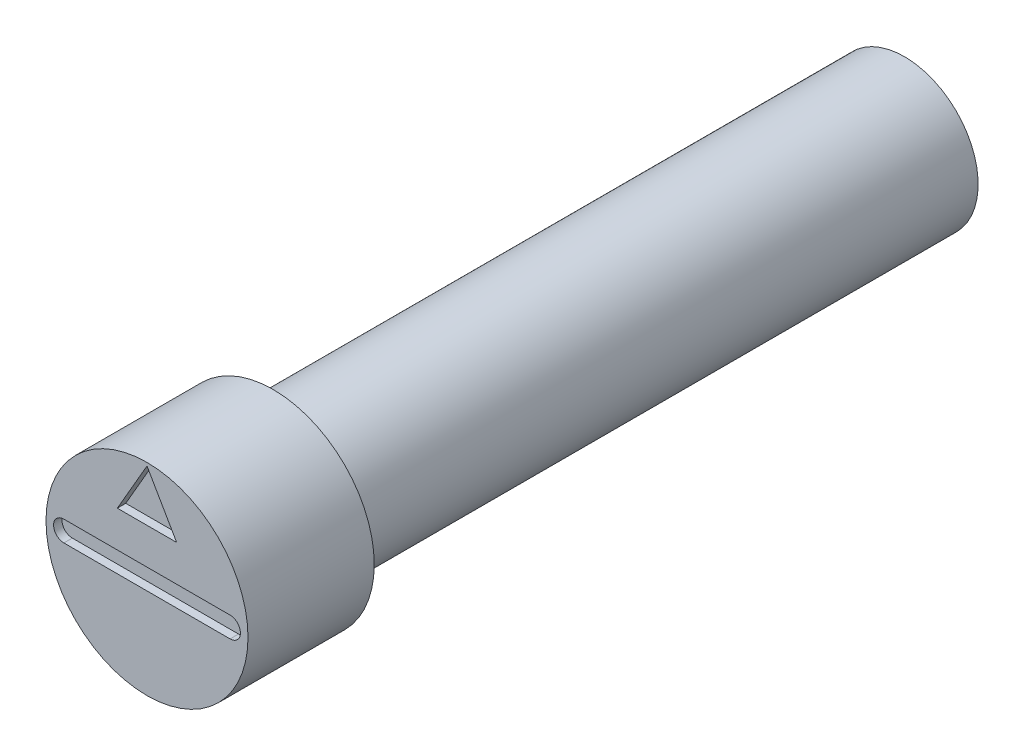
ISO-10303-21;
HEADER;
FILE_DESCRIPTION(('STEP AP214'),'2;1');
FILE_NAME('part.step','',(''),(''),'','','');
FILE_SCHEMA(('AUTOMOTIVE_DESIGN { 1 0 10303 214 1 1 1 1 }'));
ENDSEC;
DATA;
#1=APPLICATION_CONTEXT('core data for automotive mechanical design processes');
#2=APPLICATION_PROTOCOL_DEFINITION('international standard','automotive_design',2000,#1);
#3=PRODUCT_CONTEXT('',#1,'mechanical');
#4=PRODUCT('Part','Part','',(#3));
#5=PRODUCT_RELATED_PRODUCT_CATEGORY('part','',(#4));
#6=PRODUCT_DEFINITION_FORMATION('','',#4);
#7=PRODUCT_DEFINITION_CONTEXT('part definition',#1,'design');
#8=PRODUCT_DEFINITION('design','',#6,#7);
#9=PRODUCT_DEFINITION_SHAPE('','',#8);
#10=(LENGTH_UNIT() NAMED_UNIT(*) SI_UNIT(.MILLI.,.METRE.));
#11=(NAMED_UNIT(*) PLANE_ANGLE_UNIT() SI_UNIT($,.RADIAN.));
#12=(NAMED_UNIT(*) SI_UNIT($,.STERADIAN.) SOLID_ANGLE_UNIT());
#13=UNCERTAINTY_MEASURE_WITH_UNIT(LENGTH_MEASURE(1.E-05),#10,'distance_accuracy_value','');
#14=(GEOMETRIC_REPRESENTATION_CONTEXT(3) GLOBAL_UNCERTAINTY_ASSIGNED_CONTEXT((#13)) GLOBAL_UNIT_ASSIGNED_CONTEXT((#10,
#11,#12)) REPRESENTATION_CONTEXT('',''));
#15=CARTESIAN_POINT('',(0.,0.,0.));
#16=DIRECTION('',(0.,0.,1.));
#17=DIRECTION('',(1.,0.,0.));
#18=AXIS2_PLACEMENT_3D('',#15,#16,#17);
#19=CARTESIAN_POINT('',(1.1999976,0.,0.));
#20=DIRECTION('',(0.,0.,1.));
#21=DIRECTION('',(1.,0.,0.));
#22=AXIS2_PLACEMENT_3D('',#19,#20,#21);
#23=PLANE('',#22);
#24=CARTESIAN_POINT('',(-1.975,0.,0.));
#25=DIRECTION('',(0.,0.,1.));
#26=DIRECTION('',(1.,0.,0.));
#27=AXIS2_PLACEMENT_3D('',#24,#25,#26);
#28=CIRCLE('',#27,0.245);
#29=CARTESIAN_POINT('',(-1.975,0.245,0.));
#30=VERTEX_POINT('',#29);
#31=CARTESIAN_POINT('',(-1.975,-0.245,0.));
#32=VERTEX_POINT('',#31);
#33=EDGE_CURVE('E52',#30,#32,#28,.T.);
#34=ORIENTED_EDGE('',*,*,#33,.F.);
#35=DIRECTION('',(-1.,0.,0.));
#36=VECTOR('',#35,1.);
#37=CARTESIAN_POINT('',(-1.975,0.245,0.));
#38=LINE('',#37,#36);
#39=CARTESIAN_POINT('',(1.975,0.245,0.));
#40=VERTEX_POINT('',#39);
#41=EDGE_CURVE('E116',#40,#30,#38,.T.);
#42=ORIENTED_EDGE('',*,*,#41,.F.);
#43=CARTESIAN_POINT('',(1.975,0.,0.));
#44=DIRECTION('',(0.,0.,1.));
#45=DIRECTION('',(1.,0.,0.));
#46=AXIS2_PLACEMENT_3D('',#43,#44,#45);
#47=CIRCLE('',#46,0.245);
#48=CARTESIAN_POINT('',(1.975,-0.245,0.));
#49=VERTEX_POINT('',#48);
#50=EDGE_CURVE('E119',#49,#40,#47,.T.);
#51=ORIENTED_EDGE('',*,*,#50,.F.);
#52=DIRECTION('',(1.,0.,0.));
#53=VECTOR('',#52,1.);
#54=CARTESIAN_POINT('',(-1.975,-0.245,0.));
#55=LINE('',#54,#53);
#56=EDGE_CURVE('E125',#32,#49,#55,.T.);
#57=ORIENTED_EDGE('',*,*,#56,.F.);
#58=EDGE_LOOP('',(#34,#42,#51,#57));
#59=FACE_BOUND('',#58,.T.);
#60=DIRECTION('',(-0.499999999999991,0.866025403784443,0.));
#61=VECTOR('',#60,1.);
#62=CARTESIAN_POINT('',(0.704999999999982,1.105,0.));
#63=LINE('',#62,#61);
#64=CARTESIAN_POINT('',(0.704999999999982,1.105,0.));
#65=VERTEX_POINT('',#64);
#66=CARTESIAN_POINT('',(0.,2.32609581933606,0.));
#67=VERTEX_POINT('',#66);
#68=EDGE_CURVE('E60',#65,#67,#63,.T.);
#69=ORIENTED_EDGE('',*,*,#68,.F.);
#70=DIRECTION('',(1.,0.,0.));
#71=VECTOR('',#70,1.);
#72=CARTESIAN_POINT('',(-0.705000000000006,1.105,0.));
#73=LINE('',#72,#71);
#74=CARTESIAN_POINT('',(-0.705000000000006,1.105,0.));
#75=VERTEX_POINT('',#74);
#76=EDGE_CURVE('E138',#75,#65,#73,.T.);
#77=ORIENTED_EDGE('',*,*,#76,.F.);
#78=DIRECTION('',(-0.500000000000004,-0.866025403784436,0.));
#79=VECTOR('',#78,1.);
#80=CARTESIAN_POINT('',(0.,2.32609581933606,0.));
#81=LINE('',#80,#79);
#82=EDGE_CURVE('E146',#67,#75,#81,.T.);
#83=ORIENTED_EDGE('',*,*,#82,.F.);
#84=EDGE_LOOP('',(#69,#77,#83));
#85=FACE_BOUND('',#84,.T.);
#86=CARTESIAN_POINT('',(0.,0.,0.));
#87=DIRECTION('',(0.,0.,-1.));
#88=DIRECTION('',(-1.,0.,0.));
#89=AXIS2_PLACEMENT_3D('',#86,#87,#88);
#90=CIRCLE('',#89,2.3999952);
#91=CARTESIAN_POINT('',(-2.3999952,0.,0.));
#92=VERTEX_POINT('',#91);
#93=EDGE_CURVE('E39',#92,#92,#90,.T.);
#94=ORIENTED_EDGE('',*,*,#93,.F.);
#95=EDGE_LOOP('',(#94));
#96=FACE_BOUND('',#95,.T.);
#97=ADVANCED_FACE('F36',(#59,#85,#96),#23,.T.);
#98=CARTESIAN_POINT('',(0.,0.,-1.499997));
#99=DIRECTION('',(0.,0.,-1.));
#100=DIRECTION('',(-1.,0.,0.));
#101=AXIS2_PLACEMENT_3D('',#98,#99,#100);
#102=CYLINDRICAL_SURFACE('',#101,2.3999952);
#103=ORIENTED_EDGE('',*,*,#93,.T.);
#104=EDGE_LOOP('',(#103));
#105=FACE_BOUND('',#104,.T.);
#106=CARTESIAN_POINT('',(0.,0.,-2.999994));
#107=DIRECTION('',(0.,0.,-1.));
#108=DIRECTION('',(-1.,0.,0.));
#109=AXIS2_PLACEMENT_3D('',#106,#107,#108);
#110=CIRCLE('',#109,2.3999952);
#111=CARTESIAN_POINT('',(-2.3999952,0.,-2.999994));
#112=VERTEX_POINT('',#111);
#113=EDGE_CURVE('E157',#112,#112,#110,.T.);
#114=ORIENTED_EDGE('',*,*,#113,.F.);
#115=EDGE_LOOP('',(#114));
#116=FACE_BOUND('',#115,.T.);
#117=ADVANCED_FACE('F164',(#105,#116),#102,.T.);
#118=CARTESIAN_POINT('',(0.87499825,0.,-17.999964));
#119=DIRECTION('',(0.,0.,-1.));
#120=DIRECTION('',(-1.,0.,0.));
#121=AXIS2_PLACEMENT_3D('',#118,#119,#120);
#122=PLANE('',#121);
#123=CARTESIAN_POINT('',(0.,0.,-17.999964));
#124=DIRECTION('',(0.,0.,-1.));
#125=DIRECTION('',(-1.,0.,0.));
#126=AXIS2_PLACEMENT_3D('',#123,#124,#125);
#127=CIRCLE('',#126,1.7499965);
#128=CARTESIAN_POINT('',(-1.74999649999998,0.,-17.999964));
#129=VERTEX_POINT('',#128);
#130=EDGE_CURVE('E44',#129,#129,#127,.F.);
#131=ORIENTED_EDGE('',*,*,#130,.F.);
#132=EDGE_LOOP('',(#131));
#133=FACE_BOUND('',#132,.T.);
#134=ADVANCED_FACE('F173',(#133),#122,.T.);
#135=CARTESIAN_POINT('',(2.07499585,0.,-2.999994));
#136=DIRECTION('',(0.,0.,-1.));
#137=DIRECTION('',(-1.,0.,0.));
#138=AXIS2_PLACEMENT_3D('',#135,#136,#137);
#139=PLANE('',#138);
#140=CARTESIAN_POINT('',(0.,0.,-2.999994));
#141=DIRECTION('',(0.,0.,-1.));
#142=DIRECTION('',(-1.,0.,0.));
#143=AXIS2_PLACEMENT_3D('',#140,#141,#142);
#144=CIRCLE('',#143,1.7499965);
#145=CARTESIAN_POINT('',(-1.74999649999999,0.,-2.999994));
#146=VERTEX_POINT('',#145);
#147=EDGE_CURVE('E11',#146,#146,#144,.T.);
#148=ORIENTED_EDGE('',*,*,#147,.F.);
#149=EDGE_LOOP('',(#148));
#150=FACE_BOUND('',#149,.T.);
#151=ORIENTED_EDGE('',*,*,#113,.T.);
#152=EDGE_LOOP('',(#151));
#153=FACE_BOUND('',#152,.T.);
#154=ADVANCED_FACE('F180',(#150,#153),#139,.T.);
#155=CARTESIAN_POINT('',(0.,0.,-10.499979));
#156=DIRECTION('',(0.,0.,-1.));
#157=DIRECTION('',(-1.,0.,0.));
#158=AXIS2_PLACEMENT_3D('',#155,#156,#157);
#159=CYLINDRICAL_SURFACE('',#158,1.7499965);
#160=ORIENTED_EDGE('',*,*,#130,.T.);
#161=EDGE_LOOP('',(#160));
#162=FACE_BOUND('',#161,.T.);
#163=ORIENTED_EDGE('',*,*,#147,.T.);
#164=EDGE_LOOP('',(#163));
#165=FACE_BOUND('',#164,.T.);
#166=ADVANCED_FACE('F177',(#162,#165),#159,.T.);
#167=CARTESIAN_POINT('',(0.704999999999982,1.105,-0.2));
#168=DIRECTION('',(0.866025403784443,0.499999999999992,0.));
#169=DIRECTION('',(-0.499999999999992,0.866025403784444,0.));
#170=AXIS2_PLACEMENT_3D('',#167,#168,#169);
#171=PLANE('',#170);
#172=ORIENTED_EDGE('',*,*,#68,.T.);
#173=DIRECTION('',(0.,0.,1.));
#174=VECTOR('',#173,1.);
#175=CARTESIAN_POINT('',(0.,2.32609581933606,-0.2));
#176=LINE('',#175,#174);
#177=CARTESIAN_POINT('',(0.,2.32609581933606,-0.2));
#178=VERTEX_POINT('',#177);
#179=EDGE_CURVE('E144',#178,#67,#176,.T.);
#180=ORIENTED_EDGE('',*,*,#179,.F.);
#181=DIRECTION('',(-0.499999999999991,0.866025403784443,0.));
#182=VECTOR('',#181,1.);
#183=CARTESIAN_POINT('',(0.704999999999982,1.105,-0.2));
#184=LINE('',#183,#182);
#185=CARTESIAN_POINT('',(0.704999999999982,1.105,-0.2));
#186=VERTEX_POINT('',#185);
#187=EDGE_CURVE('E134',#186,#178,#184,.T.);
#188=ORIENTED_EDGE('',*,*,#187,.F.);
#189=DIRECTION('',(0.,0.,1.));
#190=VECTOR('',#189,1.);
#191=CARTESIAN_POINT('',(0.704999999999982,1.105,-0.2));
#192=LINE('',#191,#190);
#193=EDGE_CURVE('E151',#186,#65,#192,.T.);
#194=ORIENTED_EDGE('',*,*,#193,.T.);
#195=EDGE_LOOP('',(#172,#180,#188,#194));
#196=FACE_BOUND('',#195,.T.);
#197=ADVANCED_FACE('F169',(#196),#171,.F.);
#198=CARTESIAN_POINT('',(-0.705000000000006,1.105,-0.2));
#199=DIRECTION('',(0.,-1.,0.));
#200=DIRECTION('',(1.,0.,0.));
#201=AXIS2_PLACEMENT_3D('',#198,#199,#200);
#202=PLANE('',#201);
#203=ORIENTED_EDGE('',*,*,#76,.T.);
#204=ORIENTED_EDGE('',*,*,#193,.F.);
#205=DIRECTION('',(1.,0.,0.));
#206=VECTOR('',#205,1.);
#207=CARTESIAN_POINT('',(-0.705000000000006,1.105,-0.2));
#208=LINE('',#207,#206);
#209=CARTESIAN_POINT('',(-0.705000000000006,1.105,-0.2));
#210=VERTEX_POINT('',#209);
#211=EDGE_CURVE('E141',#210,#186,#208,.T.);
#212=ORIENTED_EDGE('',*,*,#211,.F.);
#213=DIRECTION('',(0.,0.,1.));
#214=VECTOR('',#213,1.);
#215=CARTESIAN_POINT('',(-0.705000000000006,1.105,-0.2));
#216=LINE('',#215,#214);
#217=EDGE_CURVE('E153',#210,#75,#216,.T.);
#218=ORIENTED_EDGE('',*,*,#217,.T.);
#219=EDGE_LOOP('',(#203,#204,#212,#218));
#220=FACE_BOUND('',#219,.T.);
#221=ADVANCED_FACE('F176',(#220),#202,.F.);
#222=CARTESIAN_POINT('',(0.,2.32609581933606,-0.2));
#223=DIRECTION('',(-0.866025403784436,0.500000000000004,0.));
#224=DIRECTION('',(-0.500000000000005,-0.866025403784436,0.));
#225=AXIS2_PLACEMENT_3D('',#222,#223,#224);
#226=PLANE('',#225);
#227=ORIENTED_EDGE('',*,*,#82,.T.);
#228=ORIENTED_EDGE('',*,*,#217,.F.);
#229=DIRECTION('',(-0.500000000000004,-0.866025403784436,0.));
#230=VECTOR('',#229,1.);
#231=CARTESIAN_POINT('',(0.,2.32609581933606,-0.2));
#232=LINE('',#231,#230);
#233=EDGE_CURVE('E137',#178,#210,#232,.T.);
#234=ORIENTED_EDGE('',*,*,#233,.F.);
#235=ORIENTED_EDGE('',*,*,#179,.T.);
#236=EDGE_LOOP('',(#227,#228,#234,#235));
#237=FACE_BOUND('',#236,.T.);
#238=ADVANCED_FACE('F232',(#237),#226,.F.);
#239=CARTESIAN_POINT('',(0.,0.,-0.2));
#240=DIRECTION('',(0.,0.,1.));
#241=DIRECTION('',(1.,0.,0.));
#242=AXIS2_PLACEMENT_3D('',#239,#240,#241);
#243=PLANE('',#242);
#244=ORIENTED_EDGE('',*,*,#187,.T.);
#245=ORIENTED_EDGE('',*,*,#233,.T.);
#246=ORIENTED_EDGE('',*,*,#211,.T.);
#247=EDGE_LOOP('',(#244,#245,#246));
#248=FACE_BOUND('',#247,.T.);
#249=ADVANCED_FACE('F243',(#248),#243,.T.);
#250=CARTESIAN_POINT('',(-1.975,0.,-0.2));
#251=DIRECTION('',(0.,0.,1.));
#252=DIRECTION('',(1.,0.,0.));
#253=AXIS2_PLACEMENT_3D('',#250,#251,#252);
#254=CYLINDRICAL_SURFACE('',#253,0.245);
#255=ORIENTED_EDGE('',*,*,#33,.T.);
#256=DIRECTION('',(0.,0.,1.));
#257=VECTOR('',#256,1.);
#258=CARTESIAN_POINT('',(-1.975,-0.245,-0.2));
#259=LINE('',#258,#257);
#260=CARTESIAN_POINT('',(-1.975,-0.245,-0.2));
#261=VERTEX_POINT('',#260);
#262=EDGE_CURVE('E94',#261,#32,#259,.T.);
#263=ORIENTED_EDGE('',*,*,#262,.F.);
#264=CARTESIAN_POINT('',(-1.975,0.,-0.2));
#265=DIRECTION('',(0.,0.,1.));
#266=DIRECTION('',(1.,0.,0.));
#267=AXIS2_PLACEMENT_3D('',#264,#265,#266);
#268=CIRCLE('',#267,0.245);
#269=CARTESIAN_POINT('',(-1.975,0.245,-0.2));
#270=VERTEX_POINT('',#269);
#271=EDGE_CURVE('E98',#270,#261,#268,.T.);
#272=ORIENTED_EDGE('',*,*,#271,.F.);
#273=DIRECTION('',(0.,0.,1.));
#274=VECTOR('',#273,1.);
#275=CARTESIAN_POINT('',(-1.975,0.245,-0.2));
#276=LINE('',#275,#274);
#277=EDGE_CURVE('E129',#270,#30,#276,.T.);
#278=ORIENTED_EDGE('',*,*,#277,.T.);
#279=EDGE_LOOP('',(#255,#263,#272,#278));
#280=FACE_BOUND('',#279,.T.);
#281=ADVANCED_FACE('F96',(#280),#254,.F.);
#282=CARTESIAN_POINT('',(-1.975,0.245,-0.2));
#283=DIRECTION('',(0.,1.,0.));
#284=DIRECTION('',(0.,0.,1.));
#285=AXIS2_PLACEMENT_3D('',#282,#283,#284);
#286=PLANE('',#285);
#287=ORIENTED_EDGE('',*,*,#41,.T.);
#288=ORIENTED_EDGE('',*,*,#277,.F.);
#289=DIRECTION('',(-1.,0.,0.));
#290=VECTOR('',#289,1.);
#291=CARTESIAN_POINT('',(-1.975,0.245,-0.2));
#292=LINE('',#291,#290);
#293=CARTESIAN_POINT('',(1.975,0.245,-0.2));
#294=VERTEX_POINT('',#293);
#295=EDGE_CURVE('E104',#294,#270,#292,.T.);
#296=ORIENTED_EDGE('',*,*,#295,.F.);
#297=DIRECTION('',(0.,0.,1.));
#298=VECTOR('',#297,1.);
#299=CARTESIAN_POINT('',(1.975,0.245,-0.2));
#300=LINE('',#299,#298);
#301=EDGE_CURVE('E131',#294,#40,#300,.T.);
#302=ORIENTED_EDGE('',*,*,#301,.T.);
#303=EDGE_LOOP('',(#287,#288,#296,#302));
#304=FACE_BOUND('',#303,.T.);
#305=ADVANCED_FACE('F263',(#304),#286,.F.);
#306=CARTESIAN_POINT('',(1.975,0.,-0.2));
#307=DIRECTION('',(0.,0.,1.));
#308=DIRECTION('',(1.,0.,0.));
#309=AXIS2_PLACEMENT_3D('',#306,#307,#308);
#310=CYLINDRICAL_SURFACE('',#309,0.245);
#311=ORIENTED_EDGE('',*,*,#50,.T.);
#312=ORIENTED_EDGE('',*,*,#301,.F.);
#313=CARTESIAN_POINT('',(1.975,0.,-0.2));
#314=DIRECTION('',(0.,0.,1.));
#315=DIRECTION('',(1.,0.,0.));
#316=AXIS2_PLACEMENT_3D('',#313,#314,#315);
#317=CIRCLE('',#316,0.245);
#318=CARTESIAN_POINT('',(1.975,-0.245,-0.2));
#319=VERTEX_POINT('',#318);
#320=EDGE_CURVE('E112',#319,#294,#317,.T.);
#321=ORIENTED_EDGE('',*,*,#320,.F.);
#322=DIRECTION('',(0.,0.,1.));
#323=VECTOR('',#322,1.);
#324=CARTESIAN_POINT('',(1.975,-0.245,-0.2));
#325=LINE('',#324,#323);
#326=EDGE_CURVE('E103',#319,#49,#325,.T.);
#327=ORIENTED_EDGE('',*,*,#326,.T.);
#328=EDGE_LOOP('',(#311,#312,#321,#327));
#329=FACE_BOUND('',#328,.T.);
#330=ADVANCED_FACE('F273',(#329),#310,.F.);
#331=CARTESIAN_POINT('',(-1.975,-0.245,-0.2));
#332=DIRECTION('',(0.,-1.,0.));
#333=DIRECTION('',(0.,0.,-1.));
#334=AXIS2_PLACEMENT_3D('',#331,#332,#333);
#335=PLANE('',#334);
#336=ORIENTED_EDGE('',*,*,#56,.T.);
#337=ORIENTED_EDGE('',*,*,#326,.F.);
#338=DIRECTION('',(1.,0.,0.));
#339=VECTOR('',#338,1.);
#340=CARTESIAN_POINT('',(-1.975,-0.245,-0.2));
#341=LINE('',#340,#339);
#342=EDGE_CURVE('E107',#261,#319,#341,.T.);
#343=ORIENTED_EDGE('',*,*,#342,.F.);
#344=ORIENTED_EDGE('',*,*,#262,.T.);
#345=EDGE_LOOP('',(#336,#337,#343,#344));
#346=FACE_BOUND('',#345,.T.);
#347=ADVANCED_FACE('F108',(#346),#335,.F.);
#348=CARTESIAN_POINT('',(-1.975,0.,-0.2));
#349=DIRECTION('',(0.,0.,1.));
#350=DIRECTION('',(1.,0.,0.));
#351=AXIS2_PLACEMENT_3D('',#348,#349,#350);
#352=PLANE('',#351);
#353=ORIENTED_EDGE('',*,*,#271,.T.);
#354=ORIENTED_EDGE('',*,*,#342,.T.);
#355=ORIENTED_EDGE('',*,*,#320,.T.);
#356=ORIENTED_EDGE('',*,*,#295,.T.);
#357=EDGE_LOOP('',(#353,#354,#355,#356));
#358=FACE_BOUND('',#357,.T.);
#359=ADVANCED_FACE('F114',(#358),#352,.T.);
#360=CLOSED_SHELL('',(#97,#117,#134,#154,#166,#197,#221,#238,#249,#281,#305,#330,#347,#359));
#361=MANIFOLD_SOLID_BREP('B2',#360);
#362=ADVANCED_BREP_SHAPE_REPRESENTATION('',(#18,#361),#14);
#363=SHAPE_DEFINITION_REPRESENTATION(#9,#362);
ENDSEC;
END-ISO-10303-21;
